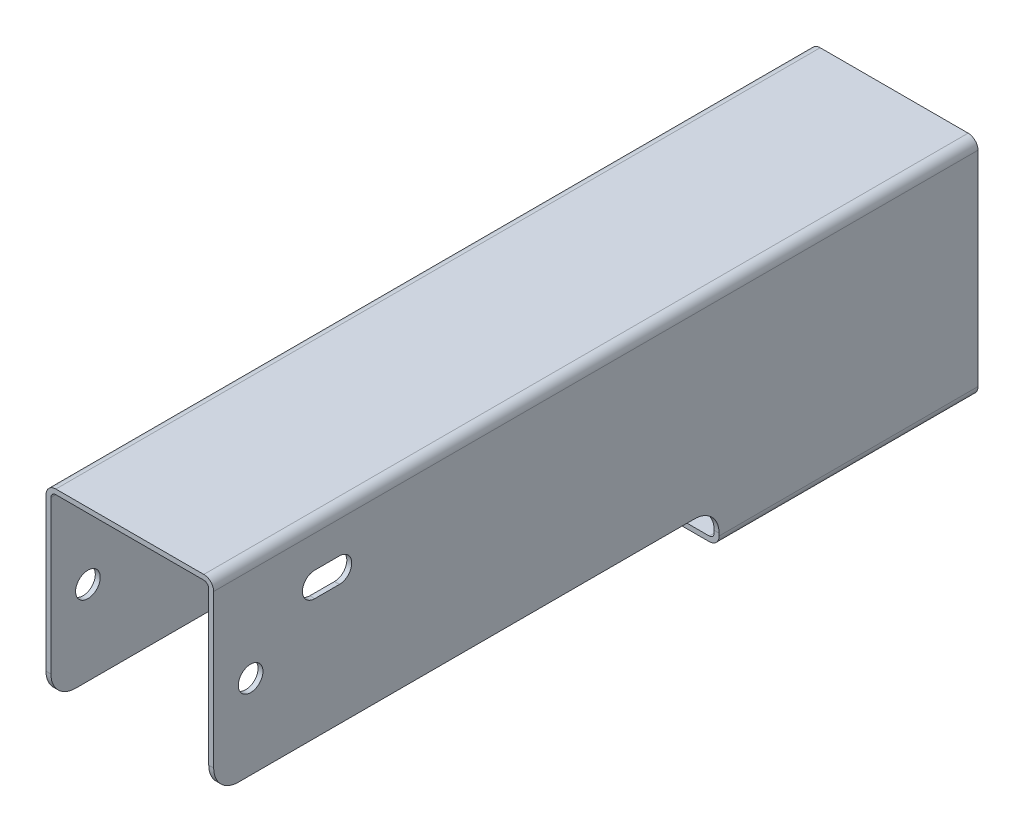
ISO-10303-21;
HEADER;
FILE_DESCRIPTION(('STEP AP214'),'2;1');
FILE_NAME('part.step','',(''),(''),'','','');
FILE_SCHEMA(('AUTOMOTIVE_DESIGN { 1 0 10303 214 1 1 1 1 }'));
ENDSEC;
DATA;
#1=APPLICATION_CONTEXT('core data for automotive mechanical design processes');
#2=APPLICATION_PROTOCOL_DEFINITION('international standard','automotive_design',2000,#1);
#3=PRODUCT_CONTEXT('',#1,'mechanical');
#4=PRODUCT('Part','Part','',(#3));
#5=PRODUCT_RELATED_PRODUCT_CATEGORY('part','',(#4));
#6=PRODUCT_DEFINITION_FORMATION('','',#4);
#7=PRODUCT_DEFINITION_CONTEXT('part definition',#1,'design');
#8=PRODUCT_DEFINITION('design','',#6,#7);
#9=PRODUCT_DEFINITION_SHAPE('','',#8);
#10=(LENGTH_UNIT() NAMED_UNIT(*) SI_UNIT(.MILLI.,.METRE.));
#11=(NAMED_UNIT(*) PLANE_ANGLE_UNIT() SI_UNIT($,.RADIAN.));
#12=(NAMED_UNIT(*) SI_UNIT($,.STERADIAN.) SOLID_ANGLE_UNIT());
#13=UNCERTAINTY_MEASURE_WITH_UNIT(LENGTH_MEASURE(1.E-05),#10,'distance_accuracy_value','');
#14=(GEOMETRIC_REPRESENTATION_CONTEXT(3) GLOBAL_UNCERTAINTY_ASSIGNED_CONTEXT((#13)) GLOBAL_UNIT_ASSIGNED_CONTEXT((#10,
#11,#12)) REPRESENTATION_CONTEXT('',''));
#15=CARTESIAN_POINT('',(0.,0.,0.));
#16=DIRECTION('',(0.,0.,1.));
#17=DIRECTION('',(1.,0.,0.));
#18=AXIS2_PLACEMENT_3D('',#15,#16,#17);
#19=CARTESIAN_POINT('',(-32.,2.,-310.));
#20=DIRECTION('',(0.,1.,0.));
#21=DIRECTION('',(0.,0.,1.));
#22=AXIS2_PLACEMENT_3D('',#19,#20,#21);
#23=PLANE('',#22);
#24=DIRECTION('',(-1.,0.,0.));
#25=VECTOR('',#24,1.);
#26=CARTESIAN_POINT('',(-32.,2.,0.));
#27=LINE('',#26,#25);
#28=CARTESIAN_POINT('',(30.,2.,0.));
#29=VERTEX_POINT('',#28);
#30=CARTESIAN_POINT('',(-30.,2.,0.));
#31=VERTEX_POINT('',#30);
#32=EDGE_CURVE('E347',#29,#31,#27,.T.);
#33=ORIENTED_EDGE('',*,*,#32,.F.);
#34=DIRECTION('',(0.,0.,-1.));
#35=VECTOR('',#34,1.);
#36=CARTESIAN_POINT('',(30.,2.,-310.));
#37=LINE('',#36,#35);
#38=CARTESIAN_POINT('',(30.,2.,-310.));
#39=VERTEX_POINT('',#38);
#40=EDGE_CURVE('E388',#29,#39,#37,.T.);
#41=ORIENTED_EDGE('',*,*,#40,.T.);
#42=DIRECTION('',(-1.,0.,0.));
#43=VECTOR('',#42,1.);
#44=CARTESIAN_POINT('',(-32.,2.,-310.));
#45=LINE('',#44,#43);
#46=CARTESIAN_POINT('',(-30.,2.,-310.));
#47=VERTEX_POINT('',#46);
#48=EDGE_CURVE('E352',#39,#47,#45,.T.);
#49=ORIENTED_EDGE('',*,*,#48,.T.);
#50=DIRECTION('',(0.,0.,1.));
#51=VECTOR('',#50,1.);
#52=CARTESIAN_POINT('',(-30.,2.,-310.));
#53=LINE('',#52,#51);
#54=EDGE_CURVE('E385',#47,#31,#53,.T.);
#55=ORIENTED_EDGE('',*,*,#54,.T.);
#56=EDGE_LOOP('',(#33,#41,#49,#55));
#57=FACE_BOUND('',#56,.T.);
#58=ADVANCED_FACE('F31',(#57),#23,.T.);
#59=CARTESIAN_POINT('',(-32.,0.,-310.));
#60=DIRECTION('',(0.,-1.,0.));
#61=DIRECTION('',(0.,0.,-1.));
#62=AXIS2_PLACEMENT_3D('',#59,#60,#61);
#63=PLANE('',#62);
#64=DIRECTION('',(1.,0.,0.));
#65=VECTOR('',#64,1.);
#66=CARTESIAN_POINT('',(-32.,0.,-310.));
#67=LINE('',#66,#65);
#68=CARTESIAN_POINT('',(-30.,0.,-310.));
#69=VERTEX_POINT('',#68);
#70=CARTESIAN_POINT('',(30.,0.,-310.));
#71=VERTEX_POINT('',#70);
#72=EDGE_CURVE('E350',#69,#71,#67,.T.);
#73=ORIENTED_EDGE('',*,*,#72,.T.);
#74=DIRECTION('',(0.,0.,1.));
#75=VECTOR('',#74,1.);
#76=CARTESIAN_POINT('',(30.,0.,0.));
#77=LINE('',#76,#75);
#78=CARTESIAN_POINT('',(30.,0.,0.));
#79=VERTEX_POINT('',#78);
#80=EDGE_CURVE('E366',#71,#79,#77,.T.);
#81=ORIENTED_EDGE('',*,*,#80,.T.);
#82=DIRECTION('',(1.,0.,0.));
#83=VECTOR('',#82,1.);
#84=CARTESIAN_POINT('',(-32.,0.,0.));
#85=LINE('',#84,#83);
#86=CARTESIAN_POINT('',(-30.,0.,0.));
#87=VERTEX_POINT('',#86);
#88=EDGE_CURVE('E351',#87,#79,#85,.T.);
#89=ORIENTED_EDGE('',*,*,#88,.F.);
#90=DIRECTION('',(0.,0.,1.));
#91=VECTOR('',#90,1.);
#92=CARTESIAN_POINT('',(-30.,0.,-310.));
#93=LINE('',#92,#91);
#94=EDGE_CURVE('E355',#87,#69,#93,.F.);
#95=ORIENTED_EDGE('',*,*,#94,.T.);
#96=EDGE_LOOP('',(#73,#81,#89,#95));
#97=FACE_BOUND('',#96,.T.);
#98=ADVANCED_FACE('F33',(#97),#63,.T.);
#99=CARTESIAN_POINT('',(-32.,2.,-310.));
#100=DIRECTION('',(0.,0.,-1.));
#101=DIRECTION('',(-1.,0.,0.));
#102=AXIS2_PLACEMENT_3D('',#99,#100,#101);
#103=PLANE('',#102);
#104=DIRECTION('',(0.,1.,0.));
#105=VECTOR('',#104,1.);
#106=CARTESIAN_POINT('',(-32.,-74.,-310.));
#107=LINE('',#106,#105);
#108=CARTESIAN_POINT('',(-32.,-85.,-310.));
#109=VERTEX_POINT('',#108);
#110=CARTESIAN_POINT('',(-32.,-2.,-310.));
#111=VERTEX_POINT('',#110);
#112=EDGE_CURVE('E324',#109,#111,#107,.T.);
#113=ORIENTED_EDGE('',*,*,#112,.F.);
#114=CARTESIAN_POINT('',(-30.,-85.,-310.));
#115=DIRECTION('',(0.,0.,-1.));
#116=DIRECTION('',(-1.,0.,0.));
#117=AXIS2_PLACEMENT_3D('',#114,#115,#116);
#118=CIRCLE('',#117,2.);
#119=CARTESIAN_POINT('',(-30.,-87.,-310.));
#120=VERTEX_POINT('',#119);
#121=EDGE_CURVE('E787',#109,#120,#118,.F.);
#122=ORIENTED_EDGE('',*,*,#121,.T.);
#123=DIRECTION('',(1.,0.,0.));
#124=VECTOR('',#123,1.);
#125=CARTESIAN_POINT('',(-32.,-87.,-310.));
#126=LINE('',#125,#124);
#127=CARTESIAN_POINT('',(30.,-87.,-310.));
#128=VERTEX_POINT('',#127);
#129=EDGE_CURVE('E297',#120,#128,#126,.T.);
#130=ORIENTED_EDGE('',*,*,#129,.T.);
#131=CARTESIAN_POINT('',(30.,-85.,-310.));
#132=DIRECTION('',(0.,0.,-1.));
#133=DIRECTION('',(-1.,0.,0.));
#134=AXIS2_PLACEMENT_3D('',#131,#132,#133);
#135=CIRCLE('',#134,2.);
#136=CARTESIAN_POINT('',(32.,-85.,-310.));
#137=VERTEX_POINT('',#136);
#138=EDGE_CURVE('E776',#128,#137,#135,.F.);
#139=ORIENTED_EDGE('',*,*,#138,.T.);
#140=DIRECTION('',(0.,1.,0.));
#141=VECTOR('',#140,1.);
#142=CARTESIAN_POINT('',(32.,-74.,-310.));
#143=LINE('',#142,#141);
#144=CARTESIAN_POINT('',(32.,-2.,-310.));
#145=VERTEX_POINT('',#144);
#146=EDGE_CURVE('E362',#137,#145,#143,.T.);
#147=ORIENTED_EDGE('',*,*,#146,.T.);
#148=CARTESIAN_POINT('',(30.,-2.,-310.));
#149=DIRECTION('',(0.,0.,-1.));
#150=DIRECTION('',(-1.,0.,0.));
#151=AXIS2_PLACEMENT_3D('',#148,#149,#150);
#152=CIRCLE('',#151,2.);
#153=EDGE_CURVE('E378',#145,#71,#152,.F.);
#154=ORIENTED_EDGE('',*,*,#153,.T.);
#155=ORIENTED_EDGE('',*,*,#72,.F.);
#156=CARTESIAN_POINT('',(-30.,-2.,-310.));
#157=DIRECTION('',(0.,0.,-1.));
#158=DIRECTION('',(-1.,0.,0.));
#159=AXIS2_PLACEMENT_3D('',#156,#157,#158);
#160=CIRCLE('',#159,2.);
#161=EDGE_CURVE('E382',#69,#111,#160,.F.);
#162=ORIENTED_EDGE('',*,*,#161,.T.);
#163=EDGE_LOOP('',(#113,#122,#130,#139,#147,#154,#155,#162));
#164=FACE_BOUND('',#163,.T.);
#165=DIRECTION('',(0.,1.,0.));
#166=VECTOR('',#165,1.);
#167=CARTESIAN_POINT('',(34.,-74.,-310.));
#168=LINE('',#167,#166);
#169=CARTESIAN_POINT('',(34.,-85.,-310.));
#170=VERTEX_POINT('',#169);
#171=CARTESIAN_POINT('',(34.,-2.,-310.));
#172=VERTEX_POINT('',#171);
#173=EDGE_CURVE('E442',#170,#172,#168,.T.);
#174=ORIENTED_EDGE('',*,*,#173,.F.);
#175=CARTESIAN_POINT('',(30.,-85.,-310.));
#176=DIRECTION('',(0.,0.,-1.));
#177=DIRECTION('',(-1.,0.,0.));
#178=AXIS2_PLACEMENT_3D('',#175,#176,#177);
#179=CIRCLE('',#178,4.);
#180=CARTESIAN_POINT('',(30.,-89.,-310.));
#181=VERTEX_POINT('',#180);
#182=EDGE_CURVE('E794',#170,#181,#179,.T.);
#183=ORIENTED_EDGE('',*,*,#182,.T.);
#184=DIRECTION('',(-1.,0.,0.));
#185=VECTOR('',#184,1.);
#186=CARTESIAN_POINT('',(34.,-89.,-310.));
#187=LINE('',#186,#185);
#188=CARTESIAN_POINT('',(-30.,-89.,-310.));
#189=VERTEX_POINT('',#188);
#190=EDGE_CURVE('E300',#181,#189,#187,.T.);
#191=ORIENTED_EDGE('',*,*,#190,.T.);
#192=CARTESIAN_POINT('',(-30.,-85.,-310.));
#193=DIRECTION('',(0.,0.,-1.));
#194=DIRECTION('',(-1.,0.,0.));
#195=AXIS2_PLACEMENT_3D('',#192,#193,#194);
#196=CIRCLE('',#195,4.);
#197=CARTESIAN_POINT('',(-34.,-85.,-310.));
#198=VERTEX_POINT('',#197);
#199=EDGE_CURVE('E547',#189,#198,#196,.T.);
#200=ORIENTED_EDGE('',*,*,#199,.T.);
#201=DIRECTION('',(0.,1.,0.));
#202=VECTOR('',#201,1.);
#203=CARTESIAN_POINT('',(-34.,-74.,-310.));
#204=LINE('',#203,#202);
#205=CARTESIAN_POINT('',(-34.,-2.,-310.));
#206=VERTEX_POINT('',#205);
#207=EDGE_CURVE('E461',#198,#206,#204,.T.);
#208=ORIENTED_EDGE('',*,*,#207,.T.);
#209=CARTESIAN_POINT('',(-30.,-2.,-310.));
#210=DIRECTION('',(0.,0.,-1.));
#211=DIRECTION('',(-1.,0.,0.));
#212=AXIS2_PLACEMENT_3D('',#209,#210,#211);
#213=CIRCLE('',#212,4.);
#214=EDGE_CURVE('E391',#206,#47,#213,.T.);
#215=ORIENTED_EDGE('',*,*,#214,.T.);
#216=ORIENTED_EDGE('',*,*,#48,.F.);
#217=CARTESIAN_POINT('',(30.,-2.,-310.));
#218=DIRECTION('',(0.,0.,-1.));
#219=DIRECTION('',(-1.,0.,0.));
#220=AXIS2_PLACEMENT_3D('',#217,#218,#219);
#221=CIRCLE('',#220,4.);
#222=EDGE_CURVE('E393',#39,#172,#221,.T.);
#223=ORIENTED_EDGE('',*,*,#222,.T.);
#224=EDGE_LOOP('',(#174,#183,#191,#200,#208,#215,#216,#223));
#225=FACE_BOUND('',#224,.T.);
#226=ADVANCED_FACE('F460',(#164,#225),#103,.T.);
#227=CARTESIAN_POINT('',(-32.,2.,0.));
#228=DIRECTION('',(0.,0.,-1.));
#229=DIRECTION('',(-1.,0.,0.));
#230=AXIS2_PLACEMENT_3D('',#227,#228,#229);
#231=PLANE('',#230);
#232=DIRECTION('',(0.,1.,0.));
#233=VECTOR('',#232,1.);
#234=CARTESIAN_POINT('',(-34.,-74.,0.));
#235=LINE('',#234,#233);
#236=CARTESIAN_POINT('',(-34.,-64.,0.));
#237=VERTEX_POINT('',#236);
#238=CARTESIAN_POINT('',(-34.,-2.,0.));
#239=VERTEX_POINT('',#238);
#240=EDGE_CURVE('E327',#237,#239,#235,.T.);
#241=ORIENTED_EDGE('',*,*,#240,.F.);
#242=DIRECTION('',(1.,0.,0.));
#243=VECTOR('',#242,1.);
#244=CARTESIAN_POINT('',(-32.,-64.,0.));
#245=LINE('',#244,#243);
#246=CARTESIAN_POINT('',(-32.,-64.,0.));
#247=VERTEX_POINT('',#246);
#248=EDGE_CURVE('E411',#237,#247,#245,.T.);
#249=ORIENTED_EDGE('',*,*,#248,.T.);
#250=DIRECTION('',(0.,1.,0.));
#251=VECTOR('',#250,1.);
#252=CARTESIAN_POINT('',(-32.,-74.,0.));
#253=LINE('',#252,#251);
#254=CARTESIAN_POINT('',(-32.,-2.,0.));
#255=VERTEX_POINT('',#254);
#256=EDGE_CURVE('E330',#247,#255,#253,.T.);
#257=ORIENTED_EDGE('',*,*,#256,.T.);
#258=CARTESIAN_POINT('',(-30.,-2.,0.));
#259=DIRECTION('',(0.,0.,-1.));
#260=DIRECTION('',(-1.,0.,0.));
#261=AXIS2_PLACEMENT_3D('',#258,#259,#260);
#262=CIRCLE('',#261,2.);
#263=EDGE_CURVE('E380',#255,#87,#262,.T.);
#264=ORIENTED_EDGE('',*,*,#263,.T.);
#265=ORIENTED_EDGE('',*,*,#88,.T.);
#266=CARTESIAN_POINT('',(30.,-2.,0.));
#267=DIRECTION('',(0.,0.,-1.));
#268=DIRECTION('',(-1.,0.,0.));
#269=AXIS2_PLACEMENT_3D('',#266,#267,#268);
#270=CIRCLE('',#269,2.);
#271=CARTESIAN_POINT('',(32.,-2.,0.));
#272=VERTEX_POINT('',#271);
#273=EDGE_CURVE('E375',#79,#272,#270,.T.);
#274=ORIENTED_EDGE('',*,*,#273,.T.);
#275=DIRECTION('',(0.,1.,0.));
#276=VECTOR('',#275,1.);
#277=CARTESIAN_POINT('',(32.,-74.,0.));
#278=LINE('',#277,#276);
#279=CARTESIAN_POINT('',(32.,-64.,0.));
#280=VERTEX_POINT('',#279);
#281=EDGE_CURVE('E336',#280,#272,#278,.T.);
#282=ORIENTED_EDGE('',*,*,#281,.F.);
#283=DIRECTION('',(1.,0.,0.));
#284=VECTOR('',#283,1.);
#285=CARTESIAN_POINT('',(34.,-64.,0.));
#286=LINE('',#285,#284);
#287=CARTESIAN_POINT('',(34.,-64.,0.));
#288=VERTEX_POINT('',#287);
#289=EDGE_CURVE('E341',#280,#288,#286,.T.);
#290=ORIENTED_EDGE('',*,*,#289,.T.);
#291=DIRECTION('',(0.,1.,0.));
#292=VECTOR('',#291,1.);
#293=CARTESIAN_POINT('',(34.,-74.,0.));
#294=LINE('',#293,#292);
#295=CARTESIAN_POINT('',(34.,-2.,0.));
#296=VERTEX_POINT('',#295);
#297=EDGE_CURVE('E339',#288,#296,#294,.T.);
#298=ORIENTED_EDGE('',*,*,#297,.T.);
#299=CARTESIAN_POINT('',(30.,-2.,0.));
#300=DIRECTION('',(0.,0.,-1.));
#301=DIRECTION('',(-1.,0.,0.));
#302=AXIS2_PLACEMENT_3D('',#299,#300,#301);
#303=CIRCLE('',#302,4.);
#304=EDGE_CURVE('E401',#296,#29,#303,.F.);
#305=ORIENTED_EDGE('',*,*,#304,.T.);
#306=ORIENTED_EDGE('',*,*,#32,.T.);
#307=CARTESIAN_POINT('',(-30.,-2.,0.));
#308=DIRECTION('',(0.,0.,-1.));
#309=DIRECTION('',(-1.,0.,0.));
#310=AXIS2_PLACEMENT_3D('',#307,#308,#309);
#311=CIRCLE('',#310,4.);
#312=EDGE_CURVE('E399',#31,#239,#311,.F.);
#313=ORIENTED_EDGE('',*,*,#312,.T.);
#314=EDGE_LOOP('',(#241,#249,#257,#264,#265,#274,#282,#290,#298,#305,#306,#313));
#315=FACE_BOUND('',#314,.T.);
#316=ADVANCED_FACE('F450',(#315),#231,.F.);
#317=CARTESIAN_POINT('',(32.,-74.,0.));
#318=DIRECTION('',(-1.,0.,0.));
#319=DIRECTION('',(0.,0.,1.));
#320=AXIS2_PLACEMENT_3D('',#317,#318,#319);
#321=PLANE('',#320);
#322=CARTESIAN_POINT('',(32.,-20.0000000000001,-51.));
#323=DIRECTION('',(-1.,0.,0.));
#324=DIRECTION('',(0.,0.,1.));
#325=AXIS2_PLACEMENT_3D('',#322,#323,#324);
#326=CIRCLE('',#325,5.);
#327=CARTESIAN_POINT('',(32.,-15.0000000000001,-51.));
#328=VERTEX_POINT('',#327);
#329=CARTESIAN_POINT('',(32.,-25.0000000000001,-51.));
#330=VERTEX_POINT('',#329);
#331=EDGE_CURVE('E285',#328,#330,#326,.T.);
#332=ORIENTED_EDGE('',*,*,#331,.F.);
#333=DIRECTION('',(0.,0.,-1.));
#334=VECTOR('',#333,1.);
#335=CARTESIAN_POINT('',(32.,-15.0000000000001,0.));
#336=LINE('',#335,#334);
#337=CARTESIAN_POINT('',(32.,-15.0000000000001,-41.));
#338=VERTEX_POINT('',#337);
#339=EDGE_CURVE('E273',#338,#328,#336,.T.);
#340=ORIENTED_EDGE('',*,*,#339,.F.);
#341=CARTESIAN_POINT('',(32.,-20.0000000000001,-41.));
#342=DIRECTION('',(-1.,0.,0.));
#343=DIRECTION('',(0.,0.,1.));
#344=AXIS2_PLACEMENT_3D('',#341,#342,#343);
#345=CIRCLE('',#344,5.);
#346=CARTESIAN_POINT('',(32.,-25.0000000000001,-41.));
#347=VERTEX_POINT('',#346);
#348=EDGE_CURVE('E245',#347,#338,#345,.T.);
#349=ORIENTED_EDGE('',*,*,#348,.F.);
#350=DIRECTION('',(0.,0.,1.));
#351=VECTOR('',#350,1.);
#352=CARTESIAN_POINT('',(32.,-25.0000000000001,0.));
#353=LINE('',#352,#351);
#354=EDGE_CURVE('E280',#330,#347,#353,.T.);
#355=ORIENTED_EDGE('',*,*,#354,.F.);
#356=EDGE_LOOP('',(#332,#340,#349,#355));
#357=FACE_BOUND('',#356,.T.);
#358=CARTESIAN_POINT('',(32.,-40.0000000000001,-15.));
#359=DIRECTION('',(-1.,0.,0.));
#360=DIRECTION('',(0.,0.,1.));
#361=AXIS2_PLACEMENT_3D('',#358,#359,#360);
#362=CIRCLE('',#361,5.);
#363=CARTESIAN_POINT('',(32.,-40.0000000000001,-20.));
#364=VERTEX_POINT('',#363);
#365=EDGE_CURVE('E294',#364,#364,#362,.T.);
#366=ORIENTED_EDGE('',*,*,#365,.F.);
#367=EDGE_LOOP('',(#366));
#368=FACE_BOUND('',#367,.T.);
#369=ORIENTED_EDGE('',*,*,#146,.F.);
#370=DIRECTION('',(0.,0.,-1.));
#371=VECTOR('',#370,1.);
#372=CARTESIAN_POINT('',(32.,-85.,-205.));
#373=LINE('',#372,#371);
#374=CARTESIAN_POINT('',(32.,-85.,-205.));
#375=VERTEX_POINT('',#374);
#376=EDGE_CURVE('E439',#137,#375,#373,.F.);
#377=ORIENTED_EDGE('',*,*,#376,.T.);
#378=DIRECTION('',(0.,1.,0.));
#379=VECTOR('',#378,1.);
#380=CARTESIAN_POINT('',(32.,-87.,-205.));
#381=LINE('',#380,#379);
#382=CARTESIAN_POINT('',(32.,-84.,-205.));
#383=VERTEX_POINT('',#382);
#384=EDGE_CURVE('E308',#375,#383,#381,.T.);
#385=ORIENTED_EDGE('',*,*,#384,.T.);
#386=CARTESIAN_POINT('',(32.,-84.,-195.));
#387=DIRECTION('',(-1.,0.,0.));
#388=DIRECTION('',(0.,0.,1.));
#389=AXIS2_PLACEMENT_3D('',#386,#387,#388);
#390=CIRCLE('',#389,10.);
#391=CARTESIAN_POINT('',(32.,-74.,-195.));
#392=VERTEX_POINT('',#391);
#393=EDGE_CURVE('E482',#383,#392,#390,.F.);
#394=ORIENTED_EDGE('',*,*,#393,.T.);
#395=DIRECTION('',(0.,0.,1.));
#396=VECTOR('',#395,1.);
#397=CARTESIAN_POINT('',(32.,-74.,0.));
#398=LINE('',#397,#396);
#399=CARTESIAN_POINT('',(32.,-74.,-10.));
#400=VERTEX_POINT('',#399);
#401=EDGE_CURVE('E333',#392,#400,#398,.T.);
#402=ORIENTED_EDGE('',*,*,#401,.T.);
#403=CARTESIAN_POINT('',(32.,-64.,-10.));
#404=DIRECTION('',(-1.,0.,0.));
#405=DIRECTION('',(0.,0.,1.));
#406=AXIS2_PLACEMENT_3D('',#403,#404,#405);
#407=CIRCLE('',#406,10.);
#408=EDGE_CURVE('E432',#400,#280,#407,.T.);
#409=ORIENTED_EDGE('',*,*,#408,.T.);
#410=ORIENTED_EDGE('',*,*,#281,.T.);
#411=DIRECTION('',(0.,0.,1.));
#412=VECTOR('',#411,1.);
#413=CARTESIAN_POINT('',(32.,-2.,-310.));
#414=LINE('',#413,#412);
#415=EDGE_CURVE('E369',#272,#145,#414,.F.);
#416=ORIENTED_EDGE('',*,*,#415,.T.);
#417=EDGE_LOOP('',(#369,#377,#385,#394,#402,#409,#410,#416));
#418=FACE_BOUND('',#417,.T.);
#419=ADVANCED_FACE('F583',(#357,#368,#418),#321,.T.);
#420=CARTESIAN_POINT('',(34.,-74.,0.));
#421=DIRECTION('',(1.,0.,0.));
#422=DIRECTION('',(0.,0.,-1.));
#423=AXIS2_PLACEMENT_3D('',#420,#421,#422);
#424=PLANE('',#423);
#425=CARTESIAN_POINT('',(34.,-20.0000000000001,-51.));
#426=DIRECTION('',(1.,0.,0.));
#427=DIRECTION('',(0.,0.,-1.));
#428=AXIS2_PLACEMENT_3D('',#425,#426,#427);
#429=CIRCLE('',#428,5.);
#430=CARTESIAN_POINT('',(34.,-25.0000000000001,-51.));
#431=VERTEX_POINT('',#430);
#432=CARTESIAN_POINT('',(34.,-15.0000000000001,-51.));
#433=VERTEX_POINT('',#432);
#434=EDGE_CURVE('E54',#431,#433,#429,.T.);
#435=ORIENTED_EDGE('',*,*,#434,.F.);
#436=DIRECTION('',(0.,0.,-1.));
#437=VECTOR('',#436,1.);
#438=CARTESIAN_POINT('',(34.,-25.0000000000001,-41.));
#439=LINE('',#438,#437);
#440=CARTESIAN_POINT('',(34.,-25.0000000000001,-41.));
#441=VERTEX_POINT('',#440);
#442=EDGE_CURVE('E259',#441,#431,#439,.T.);
#443=ORIENTED_EDGE('',*,*,#442,.F.);
#444=CARTESIAN_POINT('',(34.,-20.0000000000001,-41.));
#445=DIRECTION('',(1.,0.,0.));
#446=DIRECTION('',(0.,0.,-1.));
#447=AXIS2_PLACEMENT_3D('',#444,#445,#446);
#448=CIRCLE('',#447,5.);
#449=CARTESIAN_POINT('',(34.,-15.0000000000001,-41.));
#450=VERTEX_POINT('',#449);
#451=EDGE_CURVE('E242',#450,#441,#448,.T.);
#452=ORIENTED_EDGE('',*,*,#451,.F.);
#453=DIRECTION('',(0.,0.,1.));
#454=VECTOR('',#453,1.);
#455=CARTESIAN_POINT('',(34.,-15.0000000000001,-51.));
#456=LINE('',#455,#454);
#457=EDGE_CURVE('E251',#433,#450,#456,.T.);
#458=ORIENTED_EDGE('',*,*,#457,.F.);
#459=EDGE_LOOP('',(#435,#443,#452,#458));
#460=FACE_BOUND('',#459,.T.);
#461=CARTESIAN_POINT('',(34.,-40.0000000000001,-15.));
#462=DIRECTION('',(1.,0.,0.));
#463=DIRECTION('',(0.,0.,-1.));
#464=AXIS2_PLACEMENT_3D('',#461,#462,#463);
#465=CIRCLE('',#464,5.);
#466=CARTESIAN_POINT('',(34.,-40.0000000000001,-20.));
#467=VERTEX_POINT('',#466);
#468=EDGE_CURVE('E287',#467,#467,#465,.T.);
#469=ORIENTED_EDGE('',*,*,#468,.F.);
#470=EDGE_LOOP('',(#469));
#471=FACE_BOUND('',#470,.T.);
#472=DIRECTION('',(0.,0.,-1.));
#473=VECTOR('',#472,1.);
#474=CARTESIAN_POINT('',(34.,-74.,0.));
#475=LINE('',#474,#473);
#476=CARTESIAN_POINT('',(34.,-74.,-10.));
#477=VERTEX_POINT('',#476);
#478=CARTESIAN_POINT('',(34.,-74.,-195.));
#479=VERTEX_POINT('',#478);
#480=EDGE_CURVE('E340',#477,#479,#475,.T.);
#481=ORIENTED_EDGE('',*,*,#480,.T.);
#482=CARTESIAN_POINT('',(34.,-84.,-195.));
#483=DIRECTION('',(1.,0.,0.));
#484=DIRECTION('',(0.,0.,-1.));
#485=AXIS2_PLACEMENT_3D('',#482,#483,#484);
#486=CIRCLE('',#485,10.);
#487=CARTESIAN_POINT('',(34.,-84.,-205.));
#488=VERTEX_POINT('',#487);
#489=EDGE_CURVE('E479',#479,#488,#486,.F.);
#490=ORIENTED_EDGE('',*,*,#489,.T.);
#491=DIRECTION('',(0.,-1.,0.));
#492=VECTOR('',#491,1.);
#493=CARTESIAN_POINT('',(34.,-74.,-205.));
#494=LINE('',#493,#492);
#495=CARTESIAN_POINT('',(34.,-85.,-205.));
#496=VERTEX_POINT('',#495);
#497=EDGE_CURVE('E311',#488,#496,#494,.T.);
#498=ORIENTED_EDGE('',*,*,#497,.T.);
#499=DIRECTION('',(0.,0.,-1.));
#500=VECTOR('',#499,1.);
#501=CARTESIAN_POINT('',(34.,-85.,0.));
#502=LINE('',#501,#500);
#503=EDGE_CURVE('E791',#496,#170,#502,.T.);
#504=ORIENTED_EDGE('',*,*,#503,.T.);
#505=ORIENTED_EDGE('',*,*,#173,.T.);
#506=DIRECTION('',(0.,0.,-1.));
#507=VECTOR('',#506,1.);
#508=CARTESIAN_POINT('',(34.,-2.,0.));
#509=LINE('',#508,#507);
#510=EDGE_CURVE('E396',#172,#296,#509,.F.);
#511=ORIENTED_EDGE('',*,*,#510,.T.);
#512=ORIENTED_EDGE('',*,*,#297,.F.);
#513=CARTESIAN_POINT('',(34.,-64.,-10.));
#514=DIRECTION('',(1.,0.,0.));
#515=DIRECTION('',(0.,0.,-1.));
#516=AXIS2_PLACEMENT_3D('',#513,#514,#515);
#517=CIRCLE('',#516,10.);
#518=EDGE_CURVE('E427',#288,#477,#517,.T.);
#519=ORIENTED_EDGE('',*,*,#518,.T.);
#520=EDGE_LOOP('',(#481,#490,#498,#504,#505,#511,#512,#519));
#521=FACE_BOUND('',#520,.T.);
#522=ADVANCED_FACE('F256',(#460,#471,#521),#424,.T.);
#523=CARTESIAN_POINT('',(32.,-74.,-310.));
#524=DIRECTION('',(0.,-1.,0.));
#525=DIRECTION('',(0.,0.,-1.));
#526=AXIS2_PLACEMENT_3D('',#523,#524,#525);
#527=PLANE('',#526);
#528=ORIENTED_EDGE('',*,*,#401,.F.);
#529=DIRECTION('',(1.,0.,0.));
#530=VECTOR('',#529,1.);
#531=CARTESIAN_POINT('',(34.,-74.,-195.));
#532=LINE('',#531,#530);
#533=EDGE_CURVE('E550',#392,#479,#532,.T.);
#534=ORIENTED_EDGE('',*,*,#533,.T.);
#535=ORIENTED_EDGE('',*,*,#480,.F.);
#536=DIRECTION('',(1.,0.,0.));
#537=VECTOR('',#536,1.);
#538=CARTESIAN_POINT('',(32.,-74.,-10.));
#539=LINE('',#538,#537);
#540=EDGE_CURVE('E429',#477,#400,#539,.F.);
#541=ORIENTED_EDGE('',*,*,#540,.T.);
#542=EDGE_LOOP('',(#528,#534,#535,#541));
#543=FACE_BOUND('',#542,.T.);
#544=ADVANCED_FACE('F527',(#543),#527,.T.);
#545=CARTESIAN_POINT('',(-32.,-74.,-310.));
#546=DIRECTION('',(1.,0.,0.));
#547=DIRECTION('',(0.,0.,-1.));
#548=AXIS2_PLACEMENT_3D('',#545,#546,#547);
#549=PLANE('',#548);
#550=CARTESIAN_POINT('',(-32.,-20.0000000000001,-51.));
#551=DIRECTION('',(1.,0.,0.));
#552=DIRECTION('',(0.,0.,-1.));
#553=AXIS2_PLACEMENT_3D('',#550,#551,#552);
#554=CIRCLE('',#553,5.);
#555=CARTESIAN_POINT('',(-32.,-25.0000000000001,-51.));
#556=VERTEX_POINT('',#555);
#557=CARTESIAN_POINT('',(-32.,-15.0000000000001,-51.));
#558=VERTEX_POINT('',#557);
#559=EDGE_CURVE('E282',#556,#558,#554,.T.);
#560=ORIENTED_EDGE('',*,*,#559,.F.);
#561=DIRECTION('',(0.,0.,-1.));
#562=VECTOR('',#561,1.);
#563=CARTESIAN_POINT('',(-32.,-25.0000000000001,-310.));
#564=LINE('',#563,#562);
#565=CARTESIAN_POINT('',(-32.,-25.0000000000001,-41.));
#566=VERTEX_POINT('',#565);
#567=EDGE_CURVE('E278',#566,#556,#564,.T.);
#568=ORIENTED_EDGE('',*,*,#567,.F.);
#569=CARTESIAN_POINT('',(-32.,-20.0000000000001,-41.));
#570=DIRECTION('',(1.,0.,0.));
#571=DIRECTION('',(0.,0.,-1.));
#572=AXIS2_PLACEMENT_3D('',#569,#570,#571);
#573=CIRCLE('',#572,5.);
#574=CARTESIAN_POINT('',(-32.,-15.0000000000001,-41.));
#575=VERTEX_POINT('',#574);
#576=EDGE_CURVE('E275',#575,#566,#573,.T.);
#577=ORIENTED_EDGE('',*,*,#576,.F.);
#578=DIRECTION('',(0.,0.,1.));
#579=VECTOR('',#578,1.);
#580=CARTESIAN_POINT('',(-32.,-15.0000000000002,-310.));
#581=LINE('',#580,#579);
#582=EDGE_CURVE('E271',#558,#575,#581,.T.);
#583=ORIENTED_EDGE('',*,*,#582,.F.);
#584=EDGE_LOOP('',(#560,#568,#577,#583));
#585=FACE_BOUND('',#584,.T.);
#586=CARTESIAN_POINT('',(-32.,-40.0000000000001,-15.));
#587=DIRECTION('',(1.,0.,0.));
#588=DIRECTION('',(0.,0.,-1.));
#589=AXIS2_PLACEMENT_3D('',#586,#587,#588);
#590=CIRCLE('',#589,5.);
#591=CARTESIAN_POINT('',(-32.,-40.0000000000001,-20.));
#592=VERTEX_POINT('',#591);
#593=EDGE_CURVE('E291',#592,#592,#590,.T.);
#594=ORIENTED_EDGE('',*,*,#593,.F.);
#595=EDGE_LOOP('',(#594));
#596=FACE_BOUND('',#595,.T.);
#597=DIRECTION('',(0.,0.,-1.));
#598=VECTOR('',#597,1.);
#599=CARTESIAN_POINT('',(-32.,-74.,-310.));
#600=LINE('',#599,#598);
#601=CARTESIAN_POINT('',(-32.,-74.,-10.));
#602=VERTEX_POINT('',#601);
#603=CARTESIAN_POINT('',(-32.,-74.,-195.));
#604=VERTEX_POINT('',#603);
#605=EDGE_CURVE('E319',#602,#604,#600,.T.);
#606=ORIENTED_EDGE('',*,*,#605,.T.);
#607=CARTESIAN_POINT('',(-32.,-84.,-195.));
#608=DIRECTION('',(1.,0.,0.));
#609=DIRECTION('',(0.,0.,-1.));
#610=AXIS2_PLACEMENT_3D('',#607,#608,#609);
#611=CIRCLE('',#610,10.);
#612=CARTESIAN_POINT('',(-32.,-84.,-205.));
#613=VERTEX_POINT('',#612);
#614=EDGE_CURVE('E489',#604,#613,#611,.F.);
#615=ORIENTED_EDGE('',*,*,#614,.T.);
#616=DIRECTION('',(0.,-1.,0.));
#617=VECTOR('',#616,1.);
#618=CARTESIAN_POINT('',(-32.,-74.,-205.));
#619=LINE('',#618,#617);
#620=CARTESIAN_POINT('',(-32.,-85.,-205.));
#621=VERTEX_POINT('',#620);
#622=EDGE_CURVE('E303',#613,#621,#619,.T.);
#623=ORIENTED_EDGE('',*,*,#622,.T.);
#624=DIRECTION('',(0.,0.,-1.));
#625=VECTOR('',#624,1.);
#626=CARTESIAN_POINT('',(-32.,-85.,-310.));
#627=LINE('',#626,#625);
#628=EDGE_CURVE('E778',#621,#109,#627,.T.);
#629=ORIENTED_EDGE('',*,*,#628,.T.);
#630=ORIENTED_EDGE('',*,*,#112,.T.);
#631=DIRECTION('',(0.,0.,1.));
#632=VECTOR('',#631,1.);
#633=CARTESIAN_POINT('',(-32.,-2.,0.));
#634=LINE('',#633,#632);
#635=EDGE_CURVE('E372',#111,#255,#634,.T.);
#636=ORIENTED_EDGE('',*,*,#635,.T.);
#637=ORIENTED_EDGE('',*,*,#256,.F.);
#638=CARTESIAN_POINT('',(-32.,-64.,-10.));
#639=DIRECTION('',(1.,0.,0.));
#640=DIRECTION('',(0.,0.,-1.));
#641=AXIS2_PLACEMENT_3D('',#638,#639,#640);
#642=CIRCLE('',#641,10.);
#643=EDGE_CURVE('E416',#247,#602,#642,.T.);
#644=ORIENTED_EDGE('',*,*,#643,.T.);
#645=EDGE_LOOP('',(#606,#615,#623,#629,#630,#636,#637,#644));
#646=FACE_BOUND('',#645,.T.);
#647=ADVANCED_FACE('F470',(#585,#596,#646),#549,.T.);
#648=CARTESIAN_POINT('',(-34.,-74.,-310.));
#649=DIRECTION('',(-1.,0.,0.));
#650=DIRECTION('',(0.,0.,1.));
#651=AXIS2_PLACEMENT_3D('',#648,#649,#650);
#652=PLANE('',#651);
#653=CARTESIAN_POINT('',(-34.,-20.0000000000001,-51.));
#654=DIRECTION('',(-1.,0.,0.));
#655=DIRECTION('',(0.,0.,1.));
#656=AXIS2_PLACEMENT_3D('',#653,#654,#655);
#657=CIRCLE('',#656,5.);
#658=CARTESIAN_POINT('',(-34.,-15.0000000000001,-51.));
#659=VERTEX_POINT('',#658);
#660=CARTESIAN_POINT('',(-34.,-25.0000000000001,-51.));
#661=VERTEX_POINT('',#660);
#662=EDGE_CURVE('E11',#659,#661,#657,.T.);
#663=ORIENTED_EDGE('',*,*,#662,.F.);
#664=DIRECTION('',(0.,0.,-1.));
#665=VECTOR('',#664,1.);
#666=CARTESIAN_POINT('',(-34.,-15.0000000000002,-310.));
#667=LINE('',#666,#665);
#668=CARTESIAN_POINT('',(-34.,-15.0000000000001,-41.));
#669=VERTEX_POINT('',#668);
#670=EDGE_CURVE('E493',#669,#659,#667,.T.);
#671=ORIENTED_EDGE('',*,*,#670,.F.);
#672=CARTESIAN_POINT('',(-34.,-20.0000000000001,-41.));
#673=DIRECTION('',(-1.,0.,0.));
#674=DIRECTION('',(0.,0.,1.));
#675=AXIS2_PLACEMENT_3D('',#672,#673,#674);
#676=CIRCLE('',#675,5.);
#677=CARTESIAN_POINT('',(-34.,-25.0000000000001,-41.));
#678=VERTEX_POINT('',#677);
#679=EDGE_CURVE('E497',#678,#669,#676,.T.);
#680=ORIENTED_EDGE('',*,*,#679,.F.);
#681=DIRECTION('',(0.,0.,1.));
#682=VECTOR('',#681,1.);
#683=CARTESIAN_POINT('',(-34.,-25.0000000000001,-310.));
#684=LINE('',#683,#682);
#685=EDGE_CURVE('E39',#661,#678,#684,.T.);
#686=ORIENTED_EDGE('',*,*,#685,.F.);
#687=EDGE_LOOP('',(#663,#671,#680,#686));
#688=FACE_BOUND('',#687,.T.);
#689=CARTESIAN_POINT('',(-34.,-40.0000000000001,-15.));
#690=DIRECTION('',(-1.,0.,0.));
#691=DIRECTION('',(0.,0.,1.));
#692=AXIS2_PLACEMENT_3D('',#689,#690,#691);
#693=CIRCLE('',#692,5.);
#694=CARTESIAN_POINT('',(-34.,-40.0000000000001,-20.));
#695=VERTEX_POINT('',#694);
#696=EDGE_CURVE('E290',#695,#695,#693,.T.);
#697=ORIENTED_EDGE('',*,*,#696,.F.);
#698=EDGE_LOOP('',(#697));
#699=FACE_BOUND('',#698,.T.);
#700=ORIENTED_EDGE('',*,*,#207,.F.);
#701=DIRECTION('',(0.,0.,-1.));
#702=VECTOR('',#701,1.);
#703=CARTESIAN_POINT('',(-34.,-85.,-310.));
#704=LINE('',#703,#702);
#705=CARTESIAN_POINT('',(-34.,-85.,-205.));
#706=VERTEX_POINT('',#705);
#707=EDGE_CURVE('E541',#198,#706,#704,.F.);
#708=ORIENTED_EDGE('',*,*,#707,.T.);
#709=DIRECTION('',(0.,1.,0.));
#710=VECTOR('',#709,1.);
#711=CARTESIAN_POINT('',(-34.,-89.,-205.));
#712=LINE('',#711,#710);
#713=CARTESIAN_POINT('',(-34.,-84.,-205.));
#714=VERTEX_POINT('',#713);
#715=EDGE_CURVE('E316',#706,#714,#712,.T.);
#716=ORIENTED_EDGE('',*,*,#715,.T.);
#717=CARTESIAN_POINT('',(-34.,-84.,-195.));
#718=DIRECTION('',(-1.,0.,0.));
#719=DIRECTION('',(0.,0.,1.));
#720=AXIS2_PLACEMENT_3D('',#717,#718,#719);
#721=CIRCLE('',#720,10.);
#722=CARTESIAN_POINT('',(-34.,-74.,-195.));
#723=VERTEX_POINT('',#722);
#724=EDGE_CURVE('E491',#714,#723,#721,.F.);
#725=ORIENTED_EDGE('',*,*,#724,.T.);
#726=DIRECTION('',(0.,0.,1.));
#727=VECTOR('',#726,1.);
#728=CARTESIAN_POINT('',(-34.,-74.,-310.));
#729=LINE('',#728,#727);
#730=CARTESIAN_POINT('',(-34.,-74.,-10.));
#731=VERTEX_POINT('',#730);
#732=EDGE_CURVE('E322',#723,#731,#729,.T.);
#733=ORIENTED_EDGE('',*,*,#732,.T.);
#734=CARTESIAN_POINT('',(-34.,-64.,-10.));
#735=DIRECTION('',(-1.,0.,0.));
#736=DIRECTION('',(0.,0.,1.));
#737=AXIS2_PLACEMENT_3D('',#734,#735,#736);
#738=CIRCLE('',#737,10.);
#739=EDGE_CURVE('E425',#731,#237,#738,.T.);
#740=ORIENTED_EDGE('',*,*,#739,.T.);
#741=ORIENTED_EDGE('',*,*,#240,.T.);
#742=DIRECTION('',(0.,0.,1.));
#743=VECTOR('',#742,1.);
#744=CARTESIAN_POINT('',(-34.,-2.,-310.));
#745=LINE('',#744,#743);
#746=EDGE_CURVE('E334',#239,#206,#745,.F.);
#747=ORIENTED_EDGE('',*,*,#746,.T.);
#748=EDGE_LOOP('',(#700,#708,#716,#725,#733,#740,#741,#747));
#749=FACE_BOUND('',#748,.T.);
#750=ADVANCED_FACE('F515',(#688,#699,#749),#652,.T.);
#751=CARTESIAN_POINT('',(-32.,-74.,0.));
#752=DIRECTION('',(0.,-1.,0.));
#753=DIRECTION('',(0.,0.,-1.));
#754=AXIS2_PLACEMENT_3D('',#751,#752,#753);
#755=PLANE('',#754);
#756=ORIENTED_EDGE('',*,*,#732,.F.);
#757=DIRECTION('',(1.,0.,0.));
#758=VECTOR('',#757,1.);
#759=CARTESIAN_POINT('',(-32.,-74.,-195.));
#760=LINE('',#759,#758);
#761=EDGE_CURVE('E476',#723,#604,#760,.T.);
#762=ORIENTED_EDGE('',*,*,#761,.T.);
#763=ORIENTED_EDGE('',*,*,#605,.F.);
#764=DIRECTION('',(1.,0.,0.));
#765=VECTOR('',#764,1.);
#766=CARTESIAN_POINT('',(-34.,-74.,-10.));
#767=LINE('',#766,#765);
#768=EDGE_CURVE('E420',#602,#731,#767,.F.);
#769=ORIENTED_EDGE('',*,*,#768,.T.);
#770=EDGE_LOOP('',(#756,#762,#763,#769));
#771=FACE_BOUND('',#770,.T.);
#772=ADVANCED_FACE('F474',(#771),#755,.T.);
#773=CARTESIAN_POINT('',(30.,-2.,-310.));
#774=DIRECTION('',(0.,0.,-1.));
#775=DIRECTION('',(-1.,0.,0.));
#776=AXIS2_PLACEMENT_3D('',#773,#774,#775);
#777=CYLINDRICAL_SURFACE('',#776,2.);
#778=ORIENTED_EDGE('',*,*,#153,.F.);
#779=ORIENTED_EDGE('',*,*,#415,.F.);
#780=ORIENTED_EDGE('',*,*,#273,.F.);
#781=ORIENTED_EDGE('',*,*,#80,.F.);
#782=EDGE_LOOP('',(#778,#779,#780,#781));
#783=FACE_BOUND('',#782,.T.);
#784=ADVANCED_FACE('F594',(#783),#777,.F.);
#785=CARTESIAN_POINT('',(-30.,-2.,-310.));
#786=DIRECTION('',(0.,0.,-1.));
#787=DIRECTION('',(-1.,0.,0.));
#788=AXIS2_PLACEMENT_3D('',#785,#786,#787);
#789=CYLINDRICAL_SURFACE('',#788,2.);
#790=ORIENTED_EDGE('',*,*,#161,.F.);
#791=ORIENTED_EDGE('',*,*,#94,.F.);
#792=ORIENTED_EDGE('',*,*,#263,.F.);
#793=ORIENTED_EDGE('',*,*,#635,.F.);
#794=EDGE_LOOP('',(#790,#791,#792,#793));
#795=FACE_BOUND('',#794,.T.);
#796=ADVANCED_FACE('F597',(#795),#789,.F.);
#797=CARTESIAN_POINT('',(30.,-2.,-310.));
#798=DIRECTION('',(0.,0.,-1.));
#799=DIRECTION('',(-1.,0.,0.));
#800=AXIS2_PLACEMENT_3D('',#797,#798,#799);
#801=CYLINDRICAL_SURFACE('',#800,4.);
#802=ORIENTED_EDGE('',*,*,#304,.F.);
#803=ORIENTED_EDGE('',*,*,#510,.F.);
#804=ORIENTED_EDGE('',*,*,#222,.F.);
#805=ORIENTED_EDGE('',*,*,#40,.F.);
#806=EDGE_LOOP('',(#802,#803,#804,#805));
#807=FACE_BOUND('',#806,.T.);
#808=ADVANCED_FACE('F455',(#807),#801,.T.);
#809=CARTESIAN_POINT('',(-30.,-2.,-310.));
#810=DIRECTION('',(0.,0.,1.));
#811=DIRECTION('',(1.,0.,0.));
#812=AXIS2_PLACEMENT_3D('',#809,#810,#811);
#813=CYLINDRICAL_SURFACE('',#812,4.);
#814=ORIENTED_EDGE('',*,*,#214,.F.);
#815=ORIENTED_EDGE('',*,*,#746,.F.);
#816=ORIENTED_EDGE('',*,*,#312,.F.);
#817=ORIENTED_EDGE('',*,*,#54,.F.);
#818=EDGE_LOOP('',(#814,#815,#816,#817));
#819=FACE_BOUND('',#818,.T.);
#820=ADVANCED_FACE('F463',(#819),#813,.T.);
#821=CARTESIAN_POINT('',(-32.,-64.,-10.));
#822=DIRECTION('',(-1.,0.,0.));
#823=DIRECTION('',(0.,0.,1.));
#824=AXIS2_PLACEMENT_3D('',#821,#822,#823);
#825=CYLINDRICAL_SURFACE('',#824,10.);
#826=ORIENTED_EDGE('',*,*,#739,.F.);
#827=ORIENTED_EDGE('',*,*,#768,.F.);
#828=ORIENTED_EDGE('',*,*,#643,.F.);
#829=ORIENTED_EDGE('',*,*,#248,.F.);
#830=EDGE_LOOP('',(#826,#827,#828,#829));
#831=FACE_BOUND('',#830,.T.);
#832=ADVANCED_FACE('F466',(#831),#825,.T.);
#833=CARTESIAN_POINT('',(-32.,-64.,-10.));
#834=DIRECTION('',(-1.,0.,0.));
#835=DIRECTION('',(0.,0.,1.));
#836=AXIS2_PLACEMENT_3D('',#833,#834,#835);
#837=CYLINDRICAL_SURFACE('',#836,10.);
#838=ORIENTED_EDGE('',*,*,#408,.F.);
#839=ORIENTED_EDGE('',*,*,#540,.F.);
#840=ORIENTED_EDGE('',*,*,#518,.F.);
#841=ORIENTED_EDGE('',*,*,#289,.F.);
#842=EDGE_LOOP('',(#838,#839,#840,#841));
#843=FACE_BOUND('',#842,.T.);
#844=ADVANCED_FACE('F608',(#843),#837,.T.);
#845=CARTESIAN_POINT('',(34.,-89.,-205.));
#846=DIRECTION('',(0.,-1.,0.));
#847=DIRECTION('',(0.,0.,-1.));
#848=AXIS2_PLACEMENT_3D('',#845,#846,#847);
#849=PLANE('',#848);
#850=ORIENTED_EDGE('',*,*,#190,.F.);
#851=DIRECTION('',(0.,0.,-1.));
#852=VECTOR('',#851,1.);
#853=CARTESIAN_POINT('',(30.,-89.,-205.));
#854=LINE('',#853,#852);
#855=CARTESIAN_POINT('',(30.,-89.,-205.));
#856=VERTEX_POINT('',#855);
#857=EDGE_CURVE('E798',#181,#856,#854,.F.);
#858=ORIENTED_EDGE('',*,*,#857,.T.);
#859=DIRECTION('',(-1.,0.,0.));
#860=VECTOR('',#859,1.);
#861=CARTESIAN_POINT('',(34.,-89.,-205.));
#862=LINE('',#861,#860);
#863=CARTESIAN_POINT('',(-30.,-89.,-205.));
#864=VERTEX_POINT('',#863);
#865=EDGE_CURVE('E313',#856,#864,#862,.T.);
#866=ORIENTED_EDGE('',*,*,#865,.T.);
#867=DIRECTION('',(0.,0.,-1.));
#868=VECTOR('',#867,1.);
#869=CARTESIAN_POINT('',(-30.,-89.,-205.));
#870=LINE('',#869,#868);
#871=EDGE_CURVE('E796',#864,#189,#870,.T.);
#872=ORIENTED_EDGE('',*,*,#871,.T.);
#873=EDGE_LOOP('',(#850,#858,#866,#872));
#874=FACE_BOUND('',#873,.T.);
#875=ADVANCED_FACE('F611',(#874),#849,.T.);
#876=CARTESIAN_POINT('',(-32.,-87.,-205.));
#877=DIRECTION('',(0.,1.,0.));
#878=DIRECTION('',(-1.,0.,0.));
#879=AXIS2_PLACEMENT_3D('',#876,#877,#878);
#880=PLANE('',#879);
#881=DIRECTION('',(1.,0.,0.));
#882=VECTOR('',#881,1.);
#883=CARTESIAN_POINT('',(-32.,-87.,-205.));
#884=LINE('',#883,#882);
#885=CARTESIAN_POINT('',(-30.,-87.,-205.));
#886=VERTEX_POINT('',#885);
#887=CARTESIAN_POINT('',(30.,-87.,-205.));
#888=VERTEX_POINT('',#887);
#889=EDGE_CURVE('E305',#886,#888,#884,.T.);
#890=ORIENTED_EDGE('',*,*,#889,.T.);
#891=DIRECTION('',(0.,0.,-1.));
#892=VECTOR('',#891,1.);
#893=CARTESIAN_POINT('',(30.,-87.,-310.));
#894=LINE('',#893,#892);
#895=EDGE_CURVE('E436',#888,#128,#894,.T.);
#896=ORIENTED_EDGE('',*,*,#895,.T.);
#897=ORIENTED_EDGE('',*,*,#129,.F.);
#898=DIRECTION('',(0.,0.,-1.));
#899=VECTOR('',#898,1.);
#900=CARTESIAN_POINT('',(-30.,-87.,-205.));
#901=LINE('',#900,#899);
#902=EDGE_CURVE('E434',#120,#886,#901,.F.);
#903=ORIENTED_EDGE('',*,*,#902,.T.);
#904=EDGE_LOOP('',(#890,#896,#897,#903));
#905=FACE_BOUND('',#904,.T.);
#906=ADVANCED_FACE('F613',(#905),#880,.T.);
#907=CARTESIAN_POINT('',(32.,-74.,-205.));
#908=DIRECTION('',(0.,0.,1.));
#909=DIRECTION('',(1.,0.,0.));
#910=AXIS2_PLACEMENT_3D('',#907,#908,#909);
#911=PLANE('',#910);
#912=ORIENTED_EDGE('',*,*,#497,.F.);
#913=DIRECTION('',(1.,0.,0.));
#914=VECTOR('',#913,1.);
#915=CARTESIAN_POINT('',(32.,-84.,-205.));
#916=LINE('',#915,#914);
#917=EDGE_CURVE('E480',#488,#383,#916,.F.);
#918=ORIENTED_EDGE('',*,*,#917,.T.);
#919=ORIENTED_EDGE('',*,*,#384,.F.);
#920=CARTESIAN_POINT('',(30.,-85.,-205.));
#921=DIRECTION('',(0.,0.,1.));
#922=DIRECTION('',(1.,0.,0.));
#923=AXIS2_PLACEMENT_3D('',#920,#921,#922);
#924=CIRCLE('',#923,2.);
#925=EDGE_CURVE('E777',#375,#888,#924,.F.);
#926=ORIENTED_EDGE('',*,*,#925,.T.);
#927=ORIENTED_EDGE('',*,*,#889,.F.);
#928=CARTESIAN_POINT('',(-30.,-85.,-205.));
#929=DIRECTION('',(0.,0.,1.));
#930=DIRECTION('',(1.,0.,0.));
#931=AXIS2_PLACEMENT_3D('',#928,#929,#930);
#932=CIRCLE('',#931,2.);
#933=EDGE_CURVE('E789',#886,#621,#932,.F.);
#934=ORIENTED_EDGE('',*,*,#933,.T.);
#935=ORIENTED_EDGE('',*,*,#622,.F.);
#936=DIRECTION('',(1.,0.,0.));
#937=VECTOR('',#936,1.);
#938=CARTESIAN_POINT('',(-34.,-84.,-205.));
#939=LINE('',#938,#937);
#940=EDGE_CURVE('E484',#613,#714,#939,.F.);
#941=ORIENTED_EDGE('',*,*,#940,.T.);
#942=ORIENTED_EDGE('',*,*,#715,.F.);
#943=CARTESIAN_POINT('',(-30.,-85.,-205.));
#944=DIRECTION('',(0.,0.,1.));
#945=DIRECTION('',(1.,0.,0.));
#946=AXIS2_PLACEMENT_3D('',#943,#944,#945);
#947=CIRCLE('',#946,4.);
#948=EDGE_CURVE('E549',#706,#864,#947,.T.);
#949=ORIENTED_EDGE('',*,*,#948,.T.);
#950=ORIENTED_EDGE('',*,*,#865,.F.);
#951=CARTESIAN_POINT('',(30.,-85.,-205.));
#952=DIRECTION('',(0.,0.,1.));
#953=DIRECTION('',(1.,0.,0.));
#954=AXIS2_PLACEMENT_3D('',#951,#952,#953);
#955=CIRCLE('',#954,4.);
#956=EDGE_CURVE('E551',#856,#496,#955,.T.);
#957=ORIENTED_EDGE('',*,*,#956,.T.);
#958=EDGE_LOOP('',(#912,#918,#919,#926,#927,#934,#935,#941,#942,#949,#950,#957));
#959=FACE_BOUND('',#958,.T.);
#960=ADVANCED_FACE('F562',(#959),#911,.T.);
#961=CARTESIAN_POINT('',(30.,-85.,-205.));
#962=DIRECTION('',(0.,0.,1.));
#963=DIRECTION('',(1.,0.,0.));
#964=AXIS2_PLACEMENT_3D('',#961,#962,#963);
#965=CYLINDRICAL_SURFACE('',#964,2.);
#966=ORIENTED_EDGE('',*,*,#925,.F.);
#967=ORIENTED_EDGE('',*,*,#376,.F.);
#968=ORIENTED_EDGE('',*,*,#138,.F.);
#969=ORIENTED_EDGE('',*,*,#895,.F.);
#970=EDGE_LOOP('',(#966,#967,#968,#969));
#971=FACE_BOUND('',#970,.T.);
#972=ADVANCED_FACE('F622',(#971),#965,.F.);
#973=CARTESIAN_POINT('',(-30.,-85.,-310.));
#974=DIRECTION('',(0.,0.,1.));
#975=DIRECTION('',(1.,0.,0.));
#976=AXIS2_PLACEMENT_3D('',#973,#974,#975);
#977=CYLINDRICAL_SURFACE('',#976,2.);
#978=ORIENTED_EDGE('',*,*,#933,.F.);
#979=ORIENTED_EDGE('',*,*,#902,.F.);
#980=ORIENTED_EDGE('',*,*,#121,.F.);
#981=ORIENTED_EDGE('',*,*,#628,.F.);
#982=EDGE_LOOP('',(#978,#979,#980,#981));
#983=FACE_BOUND('',#982,.T.);
#984=ADVANCED_FACE('F625',(#983),#977,.F.);
#985=CARTESIAN_POINT('',(30.,-85.,0.));
#986=DIRECTION('',(0.,0.,-1.));
#987=DIRECTION('',(-1.,0.,0.));
#988=AXIS2_PLACEMENT_3D('',#985,#986,#987);
#989=CYLINDRICAL_SURFACE('',#988,4.);
#990=ORIENTED_EDGE('',*,*,#956,.F.);
#991=ORIENTED_EDGE('',*,*,#857,.F.);
#992=ORIENTED_EDGE('',*,*,#182,.F.);
#993=ORIENTED_EDGE('',*,*,#503,.F.);
#994=EDGE_LOOP('',(#990,#991,#992,#993));
#995=FACE_BOUND('',#994,.T.);
#996=ADVANCED_FACE('F629',(#995),#989,.T.);
#997=CARTESIAN_POINT('',(-30.,-85.,-205.));
#998=DIRECTION('',(0.,0.,-1.));
#999=DIRECTION('',(-1.,0.,0.));
#1000=AXIS2_PLACEMENT_3D('',#997,#998,#999);
#1001=CYLINDRICAL_SURFACE('',#1000,4.);
#1002=ORIENTED_EDGE('',*,*,#948,.F.);
#1003=ORIENTED_EDGE('',*,*,#707,.F.);
#1004=ORIENTED_EDGE('',*,*,#199,.F.);
#1005=ORIENTED_EDGE('',*,*,#871,.F.);
#1006=EDGE_LOOP('',(#1002,#1003,#1004,#1005));
#1007=FACE_BOUND('',#1006,.T.);
#1008=ADVANCED_FACE('F545',(#1007),#1001,.T.);
#1009=CARTESIAN_POINT('',(32.,-84.,-195.));
#1010=DIRECTION('',(-1.,0.,0.));
#1011=DIRECTION('',(0.,0.,1.));
#1012=AXIS2_PLACEMENT_3D('',#1009,#1010,#1011);
#1013=CYLINDRICAL_SURFACE('',#1012,10.);
#1014=ORIENTED_EDGE('',*,*,#393,.F.);
#1015=ORIENTED_EDGE('',*,*,#917,.F.);
#1016=ORIENTED_EDGE('',*,*,#489,.F.);
#1017=ORIENTED_EDGE('',*,*,#533,.F.);
#1018=EDGE_LOOP('',(#1014,#1015,#1016,#1017));
#1019=FACE_BOUND('',#1018,.T.);
#1020=ADVANCED_FACE('F565',(#1019),#1013,.F.);
#1021=CARTESIAN_POINT('',(-32.,-84.,-195.));
#1022=DIRECTION('',(-1.,0.,0.));
#1023=DIRECTION('',(0.,0.,1.));
#1024=AXIS2_PLACEMENT_3D('',#1021,#1022,#1023);
#1025=CYLINDRICAL_SURFACE('',#1024,10.);
#1026=ORIENTED_EDGE('',*,*,#724,.F.);
#1027=ORIENTED_EDGE('',*,*,#940,.F.);
#1028=ORIENTED_EDGE('',*,*,#614,.F.);
#1029=ORIENTED_EDGE('',*,*,#761,.F.);
#1030=EDGE_LOOP('',(#1026,#1027,#1028,#1029));
#1031=FACE_BOUND('',#1030,.T.);
#1032=ADVANCED_FACE('F535',(#1031),#1025,.F.);
#1033=CARTESIAN_POINT('',(-66.,-40.0000000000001,-15.));
#1034=DIRECTION('',(1.,0.,0.));
#1035=DIRECTION('',(0.,0.,-1.));
#1036=AXIS2_PLACEMENT_3D('',#1033,#1034,#1035);
#1037=CYLINDRICAL_SURFACE('',#1036,5.);
#1038=CARTESIAN_POINT('',(-32.,-40.0000000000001,-20.));
#1039=CARTESIAN_POINT('',(-32.0208333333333,-40.0000000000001,-20.));
#1040=CARTESIAN_POINT('',(-32.0416666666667,-40.0000000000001,-20.));
#1041=CARTESIAN_POINT('',(-32.0833333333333,-40.0000000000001,-20.));
#1042=CARTESIAN_POINT('',(-32.1041666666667,-40.0000000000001,-20.));
#1043=CARTESIAN_POINT('',(-32.1458333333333,-40.0000000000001,-20.));
#1044=CARTESIAN_POINT('',(-32.1666666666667,-40.0000000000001,-20.));
#1045=CARTESIAN_POINT('',(-32.2083333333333,-40.0000000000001,-20.));
#1046=CARTESIAN_POINT('',(-32.2291666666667,-40.0000000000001,-20.));
#1047=CARTESIAN_POINT('',(-32.2708333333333,-40.0000000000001,-20.));
#1048=CARTESIAN_POINT('',(-32.2916666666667,-40.0000000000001,-20.));
#1049=CARTESIAN_POINT('',(-32.3333333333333,-40.0000000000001,-20.));
#1050=CARTESIAN_POINT('',(-32.3541666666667,-40.0000000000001,-20.));
#1051=CARTESIAN_POINT('',(-32.3958333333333,-40.0000000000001,-20.));
#1052=CARTESIAN_POINT('',(-32.4166666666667,-40.0000000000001,-20.));
#1053=CARTESIAN_POINT('',(-32.4583333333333,-40.0000000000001,-20.));
#1054=CARTESIAN_POINT('',(-32.4791666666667,-40.0000000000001,-20.));
#1055=CARTESIAN_POINT('',(-32.5208333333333,-40.0000000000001,-20.));
#1056=CARTESIAN_POINT('',(-32.5416666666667,-40.0000000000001,-20.));
#1057=CARTESIAN_POINT('',(-32.5833333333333,-40.0000000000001,-20.));
#1058=CARTESIAN_POINT('',(-32.6041666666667,-40.0000000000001,-20.));
#1059=CARTESIAN_POINT('',(-32.6458333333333,-40.0000000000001,-20.));
#1060=CARTESIAN_POINT('',(-32.6666666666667,-40.0000000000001,-20.));
#1061=CARTESIAN_POINT('',(-32.7083333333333,-40.0000000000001,-20.));
#1062=CARTESIAN_POINT('',(-32.7291666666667,-40.0000000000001,-20.));
#1063=CARTESIAN_POINT('',(-32.7708333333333,-40.0000000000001,-20.));
#1064=CARTESIAN_POINT('',(-32.7916666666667,-40.0000000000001,-20.));
#1065=CARTESIAN_POINT('',(-32.8333333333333,-40.0000000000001,-20.));
#1066=CARTESIAN_POINT('',(-32.8541666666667,-40.0000000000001,-20.));
#1067=CARTESIAN_POINT('',(-32.8958333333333,-40.0000000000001,-20.));
#1068=CARTESIAN_POINT('',(-32.9166666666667,-40.0000000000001,-20.));
#1069=CARTESIAN_POINT('',(-32.9583333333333,-40.0000000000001,-20.));
#1070=CARTESIAN_POINT('',(-32.9791666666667,-40.0000000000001,-20.));
#1071=CARTESIAN_POINT('',(-33.0208333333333,-40.0000000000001,-20.));
#1072=CARTESIAN_POINT('',(-33.0416666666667,-40.0000000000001,-20.));
#1073=CARTESIAN_POINT('',(-33.0833333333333,-40.0000000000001,-20.));
#1074=CARTESIAN_POINT('',(-33.1041666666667,-40.0000000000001,-20.));
#1075=CARTESIAN_POINT('',(-33.1458333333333,-40.0000000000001,-20.));
#1076=CARTESIAN_POINT('',(-33.1666666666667,-40.0000000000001,-20.));
#1077=CARTESIAN_POINT('',(-33.2083333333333,-40.0000000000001,-20.));
#1078=CARTESIAN_POINT('',(-33.2291666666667,-40.0000000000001,-20.));
#1079=CARTESIAN_POINT('',(-33.2708333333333,-40.0000000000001,-20.));
#1080=CARTESIAN_POINT('',(-33.2916666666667,-40.0000000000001,-20.));
#1081=CARTESIAN_POINT('',(-33.3333333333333,-40.0000000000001,-20.));
#1082=CARTESIAN_POINT('',(-33.3541666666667,-40.0000000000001,-20.));
#1083=CARTESIAN_POINT('',(-33.3958333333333,-40.0000000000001,-20.));
#1084=CARTESIAN_POINT('',(-33.4166666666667,-40.0000000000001,-20.));
#1085=CARTESIAN_POINT('',(-33.4583333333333,-40.0000000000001,-20.));
#1086=CARTESIAN_POINT('',(-33.4791666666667,-40.0000000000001,-20.));
#1087=CARTESIAN_POINT('',(-33.5208333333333,-40.0000000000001,-20.));
#1088=CARTESIAN_POINT('',(-33.5416666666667,-40.0000000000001,-20.));
#1089=CARTESIAN_POINT('',(-33.5833333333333,-40.0000000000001,-20.));
#1090=CARTESIAN_POINT('',(-33.6041666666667,-40.0000000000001,-20.));
#1091=CARTESIAN_POINT('',(-33.6458333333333,-40.0000000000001,-20.));
#1092=CARTESIAN_POINT('',(-33.6666666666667,-40.0000000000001,-20.));
#1093=CARTESIAN_POINT('',(-33.7083333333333,-40.0000000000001,-20.));
#1094=CARTESIAN_POINT('',(-33.7291666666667,-40.0000000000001,-20.));
#1095=CARTESIAN_POINT('',(-33.7708333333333,-40.0000000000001,-20.));
#1096=CARTESIAN_POINT('',(-33.7916666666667,-40.0000000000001,-20.));
#1097=CARTESIAN_POINT('',(-33.8333333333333,-40.0000000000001,-20.));
#1098=CARTESIAN_POINT('',(-33.8541666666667,-40.0000000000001,-20.));
#1099=CARTESIAN_POINT('',(-33.8958333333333,-40.0000000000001,-20.));
#1100=CARTESIAN_POINT('',(-33.9166666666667,-40.0000000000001,-20.));
#1101=CARTESIAN_POINT('',(-33.9583333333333,-40.0000000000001,-20.));
#1102=CARTESIAN_POINT('',(-33.9791666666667,-40.0000000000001,-20.));
#1103=CARTESIAN_POINT('',(-34.,-40.0000000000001,-20.));
#1104=B_SPLINE_CURVE_WITH_KNOTS('',3,(#1038,#1039,#1040,#1041,#1042,#1043,#1044,#1045,#1046,
#1047,#1048,#1049,#1050,#1051,#1052,#1053,#1054,#1055,#1056,#1057,#1058,#1059,#1060,#1061,#1062,
#1063,#1064,#1065,#1066,#1067,#1068,#1069,#1070,#1071,#1072,#1073,#1074,#1075,#1076,#1077,#1078,
#1079,#1080,#1081,#1082,#1083,#1084,#1085,#1086,#1087,#1088,#1089,#1090,#1091,#1092,#1093,#1094,
#1095,#1096,#1097,#1098,#1099,#1100,#1101,#1102,#1103),.UNSPECIFIED.,.F.,.F.,(4,2,2,2,2,2,2,2,2,
2,2,2,2,2,2,2,2,2,2,2,2,2,2,2,2,2,2,2,2,2,2,2,4),(0.,0.0625000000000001,0.125,0.1875,0.25,
0.3125,0.375,0.4375,0.5,0.562499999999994,0.624999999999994,0.687499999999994,0.749999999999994,
0.812499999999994,0.874999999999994,0.937499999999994,0.999999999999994,1.06249999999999,
1.12499999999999,1.18749999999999,1.24999999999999,1.31249999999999,1.37499999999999,
1.43749999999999,1.49999999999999,1.56249999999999,1.62499999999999,1.68749999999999,
1.74999999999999,1.81249999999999,1.87499999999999,1.93749999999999,1.99999999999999),.UNSPECIFIED.);
#1105=EDGE_CURVE('BSEAM531',#592,#695,#1104,.T.);
#1106=ORIENTED_EDGE('',*,*,#593,.T.);
#1107=ORIENTED_EDGE('',*,*,#696,.T.);
#1108=ORIENTED_EDGE('',*,*,#1105,.T.);
#1109=ORIENTED_EDGE('',*,*,#1105,.F.);
#1110=EDGE_LOOP('',(#1106,#1108,#1107,#1109));
#1111=FACE_BOUND('',#1110,.T.);
#1112=ADVANCED_FACE('F531',(#1111),#1037,.F.);
#1113=CARTESIAN_POINT('',(32.,-40.0000000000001,-20.));
#1114=CARTESIAN_POINT('',(32.0208333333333,-40.0000000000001,-20.));
#1115=CARTESIAN_POINT('',(32.0416666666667,-40.0000000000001,-20.));
#1116=CARTESIAN_POINT('',(32.0833333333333,-40.0000000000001,-20.));
#1117=CARTESIAN_POINT('',(32.1041666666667,-40.0000000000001,-20.));
#1118=CARTESIAN_POINT('',(32.1458333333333,-40.0000000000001,-20.));
#1119=CARTESIAN_POINT('',(32.1666666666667,-40.0000000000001,-20.));
#1120=CARTESIAN_POINT('',(32.2083333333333,-40.0000000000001,-20.));
#1121=CARTESIAN_POINT('',(32.2291666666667,-40.0000000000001,-20.));
#1122=CARTESIAN_POINT('',(32.2708333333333,-40.0000000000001,-20.));
#1123=CARTESIAN_POINT('',(32.2916666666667,-40.0000000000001,-20.));
#1124=CARTESIAN_POINT('',(32.3333333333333,-40.0000000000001,-20.));
#1125=CARTESIAN_POINT('',(32.3541666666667,-40.0000000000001,-20.));
#1126=CARTESIAN_POINT('',(32.3958333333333,-40.0000000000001,-20.));
#1127=CARTESIAN_POINT('',(32.4166666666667,-40.0000000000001,-20.));
#1128=CARTESIAN_POINT('',(32.4583333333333,-40.0000000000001,-20.));
#1129=CARTESIAN_POINT('',(32.4791666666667,-40.0000000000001,-20.));
#1130=CARTESIAN_POINT('',(32.5208333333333,-40.0000000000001,-20.));
#1131=CARTESIAN_POINT('',(32.5416666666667,-40.0000000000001,-20.));
#1132=CARTESIAN_POINT('',(32.5833333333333,-40.0000000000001,-20.));
#1133=CARTESIAN_POINT('',(32.6041666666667,-40.0000000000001,-20.));
#1134=CARTESIAN_POINT('',(32.6458333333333,-40.0000000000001,-20.));
#1135=CARTESIAN_POINT('',(32.6666666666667,-40.0000000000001,-20.));
#1136=CARTESIAN_POINT('',(32.7083333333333,-40.0000000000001,-20.));
#1137=CARTESIAN_POINT('',(32.7291666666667,-40.0000000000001,-20.));
#1138=CARTESIAN_POINT('',(32.7708333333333,-40.0000000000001,-20.));
#1139=CARTESIAN_POINT('',(32.7916666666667,-40.0000000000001,-20.));
#1140=CARTESIAN_POINT('',(32.8333333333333,-40.0000000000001,-20.));
#1141=CARTESIAN_POINT('',(32.8541666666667,-40.0000000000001,-20.));
#1142=CARTESIAN_POINT('',(32.8958333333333,-40.0000000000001,-20.));
#1143=CARTESIAN_POINT('',(32.9166666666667,-40.0000000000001,-20.));
#1144=CARTESIAN_POINT('',(32.9583333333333,-40.0000000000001,-20.));
#1145=CARTESIAN_POINT('',(32.9791666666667,-40.0000000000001,-20.));
#1146=CARTESIAN_POINT('',(33.0208333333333,-40.0000000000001,-20.));
#1147=CARTESIAN_POINT('',(33.0416666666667,-40.0000000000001,-20.));
#1148=CARTESIAN_POINT('',(33.0833333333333,-40.0000000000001,-20.));
#1149=CARTESIAN_POINT('',(33.1041666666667,-40.0000000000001,-20.));
#1150=CARTESIAN_POINT('',(33.1458333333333,-40.0000000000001,-20.));
#1151=CARTESIAN_POINT('',(33.1666666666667,-40.0000000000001,-20.));
#1152=CARTESIAN_POINT('',(33.2083333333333,-40.0000000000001,-20.));
#1153=CARTESIAN_POINT('',(33.2291666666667,-40.0000000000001,-20.));
#1154=CARTESIAN_POINT('',(33.2708333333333,-40.0000000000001,-20.));
#1155=CARTESIAN_POINT('',(33.2916666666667,-40.0000000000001,-20.));
#1156=CARTESIAN_POINT('',(33.3333333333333,-40.0000000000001,-20.));
#1157=CARTESIAN_POINT('',(33.3541666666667,-40.0000000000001,-20.));
#1158=CARTESIAN_POINT('',(33.3958333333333,-40.0000000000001,-20.));
#1159=CARTESIAN_POINT('',(33.4166666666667,-40.0000000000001,-20.));
#1160=CARTESIAN_POINT('',(33.4583333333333,-40.0000000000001,-20.));
#1161=CARTESIAN_POINT('',(33.4791666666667,-40.0000000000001,-20.));
#1162=CARTESIAN_POINT('',(33.5208333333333,-40.0000000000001,-20.));
#1163=CARTESIAN_POINT('',(33.5416666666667,-40.0000000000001,-20.));
#1164=CARTESIAN_POINT('',(33.5833333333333,-40.0000000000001,-20.));
#1165=CARTESIAN_POINT('',(33.6041666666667,-40.0000000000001,-20.));
#1166=CARTESIAN_POINT('',(33.6458333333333,-40.0000000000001,-20.));
#1167=CARTESIAN_POINT('',(33.6666666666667,-40.0000000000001,-20.));
#1168=CARTESIAN_POINT('',(33.7083333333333,-40.0000000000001,-20.));
#1169=CARTESIAN_POINT('',(33.7291666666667,-40.0000000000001,-20.));
#1170=CARTESIAN_POINT('',(33.7708333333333,-40.0000000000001,-20.));
#1171=CARTESIAN_POINT('',(33.7916666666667,-40.0000000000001,-20.));
#1172=CARTESIAN_POINT('',(33.8333333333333,-40.0000000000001,-20.));
#1173=CARTESIAN_POINT('',(33.8541666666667,-40.0000000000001,-20.));
#1174=CARTESIAN_POINT('',(33.8958333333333,-40.0000000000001,-20.));
#1175=CARTESIAN_POINT('',(33.9166666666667,-40.0000000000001,-20.));
#1176=CARTESIAN_POINT('',(33.9583333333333,-40.0000000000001,-20.));
#1177=CARTESIAN_POINT('',(33.9791666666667,-40.0000000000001,-20.));
#1178=CARTESIAN_POINT('',(34.,-40.0000000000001,-20.));
#1179=B_SPLINE_CURVE_WITH_KNOTS('',3,(#1113,#1114,#1115,#1116,#1117,#1118,#1119,#1120,#1121,
#1122,#1123,#1124,#1125,#1126,#1127,#1128,#1129,#1130,#1131,#1132,#1133,#1134,#1135,#1136,#1137,
#1138,#1139,#1140,#1141,#1142,#1143,#1144,#1145,#1146,#1147,#1148,#1149,#1150,#1151,#1152,#1153,
#1154,#1155,#1156,#1157,#1158,#1159,#1160,#1161,#1162,#1163,#1164,#1165,#1166,#1167,#1168,#1169,
#1170,#1171,#1172,#1173,#1174,#1175,#1176,#1177,#1178),.UNSPECIFIED.,.F.,.F.,(4,2,2,2,2,2,2,2,2,
2,2,2,2,2,2,2,2,2,2,2,2,2,2,2,2,2,2,2,2,2,2,2,4),(0.,0.0624999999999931,0.125,0.187500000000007,
0.25,0.312499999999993,0.375,0.437500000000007,0.5,0.562499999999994,0.625000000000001,
0.687500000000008,0.750000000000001,0.812499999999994,0.875000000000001,0.937500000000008,1.,
1.06249999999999,1.125,1.18750000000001,1.25,1.31249999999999,1.375,1.43750000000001,1.5,
1.56249999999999,1.625,1.68750000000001,1.75,1.81249999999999,1.875,1.93750000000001,2.),.UNSPECIFIED.);
#1180=EDGE_CURVE('BSEAM534',#364,#467,#1179,.T.);
#1181=ORIENTED_EDGE('',*,*,#365,.T.);
#1182=ORIENTED_EDGE('',*,*,#468,.T.);
#1183=ORIENTED_EDGE('',*,*,#1180,.T.);
#1184=ORIENTED_EDGE('',*,*,#1180,.F.);
#1185=EDGE_LOOP('',(#1181,#1183,#1182,#1184));
#1186=FACE_BOUND('',#1185,.T.);
#1187=ADVANCED_FACE('F534',(#1186),#1037,.F.);
#1188=CARTESIAN_POINT('',(-66.,-15.0000000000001,-51.));
#1189=DIRECTION('',(0.,1.,0.));
#1190=DIRECTION('',(0.,0.,1.));
#1191=AXIS2_PLACEMENT_3D('',#1188,#1189,#1190);
#1192=PLANE('',#1191);
#1193=ORIENTED_EDGE('',*,*,#582,.T.);
#1194=DIRECTION('',(1.,0.,0.));
#1195=VECTOR('',#1194,1.);
#1196=CARTESIAN_POINT('',(-66.,-15.0000000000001,-41.));
#1197=LINE('',#1196,#1195);
#1198=EDGE_CURVE('E247',#669,#575,#1197,.T.);
#1199=ORIENTED_EDGE('',*,*,#1198,.F.);
#1200=ORIENTED_EDGE('',*,*,#670,.T.);
#1201=DIRECTION('',(1.,0.,0.));
#1202=VECTOR('',#1201,1.);
#1203=CARTESIAN_POINT('',(-66.,-15.0000000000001,-51.));
#1204=LINE('',#1203,#1202);
#1205=EDGE_CURVE('E248',#659,#558,#1204,.T.);
#1206=ORIENTED_EDGE('',*,*,#1205,.T.);
#1207=EDGE_LOOP('',(#1193,#1199,#1200,#1206));
#1208=FACE_BOUND('',#1207,.T.);
#1209=ADVANCED_FACE('F519',(#1208),#1192,.F.);
#1210=CARTESIAN_POINT('',(-66.,-20.0000000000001,-41.));
#1211=DIRECTION('',(1.,0.,0.));
#1212=DIRECTION('',(0.,0.,-1.));
#1213=AXIS2_PLACEMENT_3D('',#1210,#1211,#1212);
#1214=CYLINDRICAL_SURFACE('',#1213,5.);
#1215=ORIENTED_EDGE('',*,*,#576,.T.);
#1216=DIRECTION('',(1.,0.,0.));
#1217=VECTOR('',#1216,1.);
#1218=CARTESIAN_POINT('',(-66.,-25.0000000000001,-41.));
#1219=LINE('',#1218,#1217);
#1220=EDGE_CURVE('E267',#678,#566,#1219,.T.);
#1221=ORIENTED_EDGE('',*,*,#1220,.F.);
#1222=ORIENTED_EDGE('',*,*,#679,.T.);
#1223=ORIENTED_EDGE('',*,*,#1198,.T.);
#1224=EDGE_LOOP('',(#1215,#1221,#1222,#1223));
#1225=FACE_BOUND('',#1224,.T.);
#1226=ADVANCED_FACE('F511',(#1225),#1214,.F.);
#1227=CARTESIAN_POINT('',(-66.,-25.0000000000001,-41.));
#1228=DIRECTION('',(0.,-1.,0.));
#1229=DIRECTION('',(0.,0.,-1.));
#1230=AXIS2_PLACEMENT_3D('',#1227,#1228,#1229);
#1231=PLANE('',#1230);
#1232=ORIENTED_EDGE('',*,*,#567,.T.);
#1233=DIRECTION('',(1.,0.,0.));
#1234=VECTOR('',#1233,1.);
#1235=CARTESIAN_POINT('',(-66.,-25.0000000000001,-51.));
#1236=LINE('',#1235,#1234);
#1237=EDGE_CURVE('E266',#661,#556,#1236,.T.);
#1238=ORIENTED_EDGE('',*,*,#1237,.F.);
#1239=ORIENTED_EDGE('',*,*,#685,.T.);
#1240=ORIENTED_EDGE('',*,*,#1220,.T.);
#1241=EDGE_LOOP('',(#1232,#1238,#1239,#1240));
#1242=FACE_BOUND('',#1241,.T.);
#1243=ADVANCED_FACE('F504',(#1242),#1231,.F.);
#1244=CARTESIAN_POINT('',(-66.,-20.0000000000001,-51.));
#1245=DIRECTION('',(1.,0.,0.));
#1246=DIRECTION('',(0.,0.,-1.));
#1247=AXIS2_PLACEMENT_3D('',#1244,#1245,#1246);
#1248=CYLINDRICAL_SURFACE('',#1247,5.);
#1249=ORIENTED_EDGE('',*,*,#559,.T.);
#1250=ORIENTED_EDGE('',*,*,#1205,.F.);
#1251=ORIENTED_EDGE('',*,*,#662,.T.);
#1252=ORIENTED_EDGE('',*,*,#1237,.T.);
#1253=EDGE_LOOP('',(#1249,#1250,#1251,#1252));
#1254=FACE_BOUND('',#1253,.T.);
#1255=ADVANCED_FACE('F521',(#1254),#1248,.F.);
#1256=ORIENTED_EDGE('',*,*,#331,.T.);
#1257=EDGE_CURVE('E264',#330,#431,#1236,.T.);
#1258=ORIENTED_EDGE('',*,*,#1257,.T.);
#1259=ORIENTED_EDGE('',*,*,#434,.T.);
#1260=EDGE_CURVE('E253',#328,#433,#1204,.T.);
#1261=ORIENTED_EDGE('',*,*,#1260,.F.);
#1262=EDGE_LOOP('',(#1256,#1258,#1259,#1261));
#1263=FACE_BOUND('',#1262,.T.);
#1264=ADVANCED_FACE('F730',(#1263),#1248,.F.);
#1265=ORIENTED_EDGE('',*,*,#354,.T.);
#1266=EDGE_CURVE('E268',#347,#441,#1219,.T.);
#1267=ORIENTED_EDGE('',*,*,#1266,.T.);
#1268=ORIENTED_EDGE('',*,*,#442,.T.);
#1269=ORIENTED_EDGE('',*,*,#1257,.F.);
#1270=EDGE_LOOP('',(#1265,#1267,#1268,#1269));
#1271=FACE_BOUND('',#1270,.T.);
#1272=ADVANCED_FACE('F722',(#1271),#1231,.F.);
#1273=ORIENTED_EDGE('',*,*,#348,.T.);
#1274=EDGE_CURVE('E46',#338,#450,#1197,.T.);
#1275=ORIENTED_EDGE('',*,*,#1274,.T.);
#1276=ORIENTED_EDGE('',*,*,#451,.T.);
#1277=ORIENTED_EDGE('',*,*,#1266,.F.);
#1278=EDGE_LOOP('',(#1273,#1275,#1276,#1277));
#1279=FACE_BOUND('',#1278,.T.);
#1280=ADVANCED_FACE('F239',(#1279),#1214,.F.);
#1281=ORIENTED_EDGE('',*,*,#339,.T.);
#1282=ORIENTED_EDGE('',*,*,#1260,.T.);
#1283=ORIENTED_EDGE('',*,*,#457,.T.);
#1284=ORIENTED_EDGE('',*,*,#1274,.F.);
#1285=EDGE_LOOP('',(#1281,#1282,#1283,#1284));
#1286=FACE_BOUND('',#1285,.T.);
#1287=ADVANCED_FACE('F252',(#1286),#1192,.F.);
#1288=CLOSED_SHELL('',(#58,#98,#226,#316,#419,#522,#544,#647,#750,#772,#784,#796,#808,#820,#832,
#844,#875,#906,#960,#972,#984,#996,#1008,#1020,#1032,#1112,#1187,#1209,#1226,#1243,#1255,#1264,
#1272,#1280,#1287));
#1289=MANIFOLD_SOLID_BREP('B2',#1288);
#1290=ADVANCED_BREP_SHAPE_REPRESENTATION('',(#18,#1289),#14);
#1291=SHAPE_DEFINITION_REPRESENTATION(#9,#1290);
ENDSEC;
END-ISO-10303-21;
